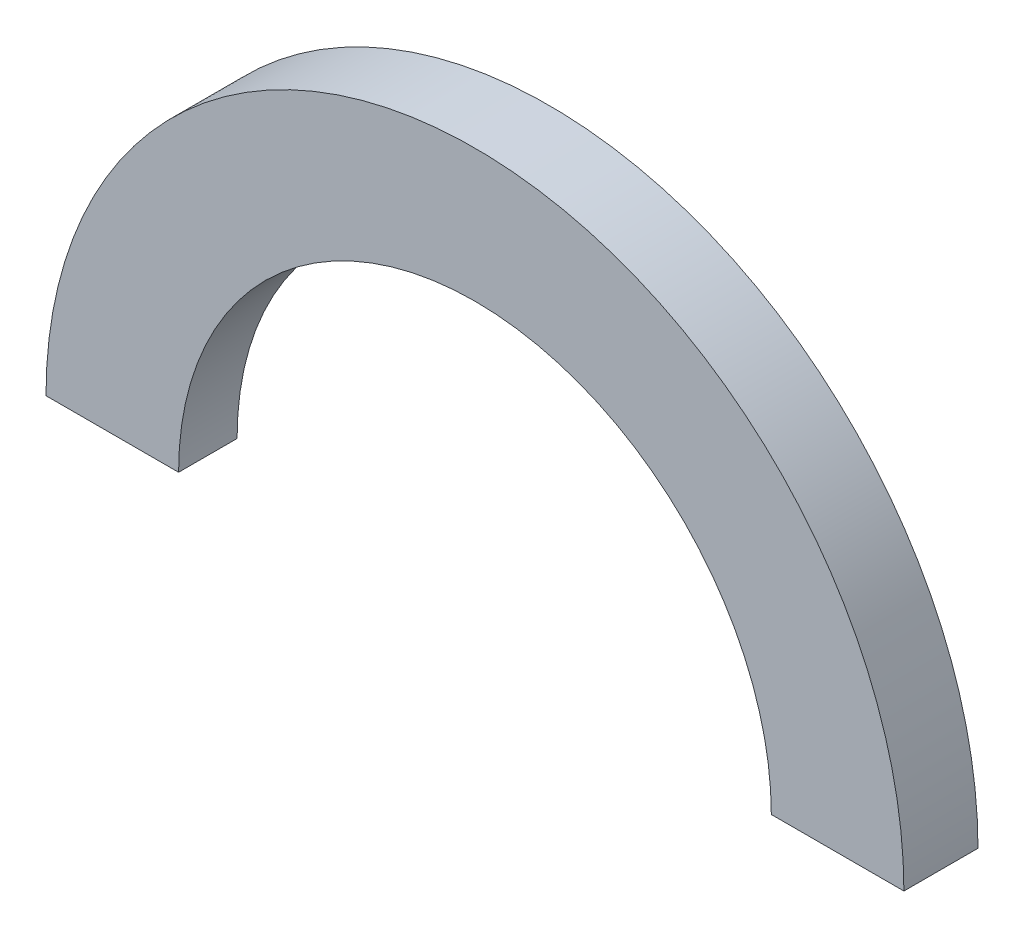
from build123d import *

# Parameters (mm, degrees)
ESQUISSE1_R             = 55
ESQUISSE1_R_2           = 38
EXTRUSION1_DEPTH        = 9.5
ESQUISSE2_R             = 41
ENL_V_MAT_EXTRU_1_DEPTH = 2
ESQUISSE3_W             = 127.621597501
ESQUISSE3_H             = 63.565372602
ENL_V_MAT_EXTRU_2_DEPTH = 79.35974732


with BuildPart() as part:
    # Esquisse1 → Extrusion1 (new body)
    with BuildSketch(Plane.XY):
        Circle(ESQUISSE1_R)
        Circle(ESQUISSE1_R_2, mode=Mode.SUBTRACT)
    extrude(amount=EXTRUSION1_DEPTH)

    # Esquisse2 → Enl_v. mat.-Extru.1 (cut)
    with BuildSketch(Plane.XY):
        Circle(ESQUISSE2_R)
    extrude(amount=ENL_V_MAT_EXTRU_1_DEPTH, mode=Mode.SUBTRACT)

    # Esquisse3 → Enl_v. mat.-Extru.2 (cut, through all)
    with BuildSketch(Plane.XY.offset(9.5)):
        with Locations((3.80410531, -31.782686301)):
            Rectangle(ESQUISSE3_W, ESQUISSE3_H)
    extrude(amount=-ENL_V_MAT_EXTRU_2_DEPTH, mode=Mode.SUBTRACT)


solid = part.part
